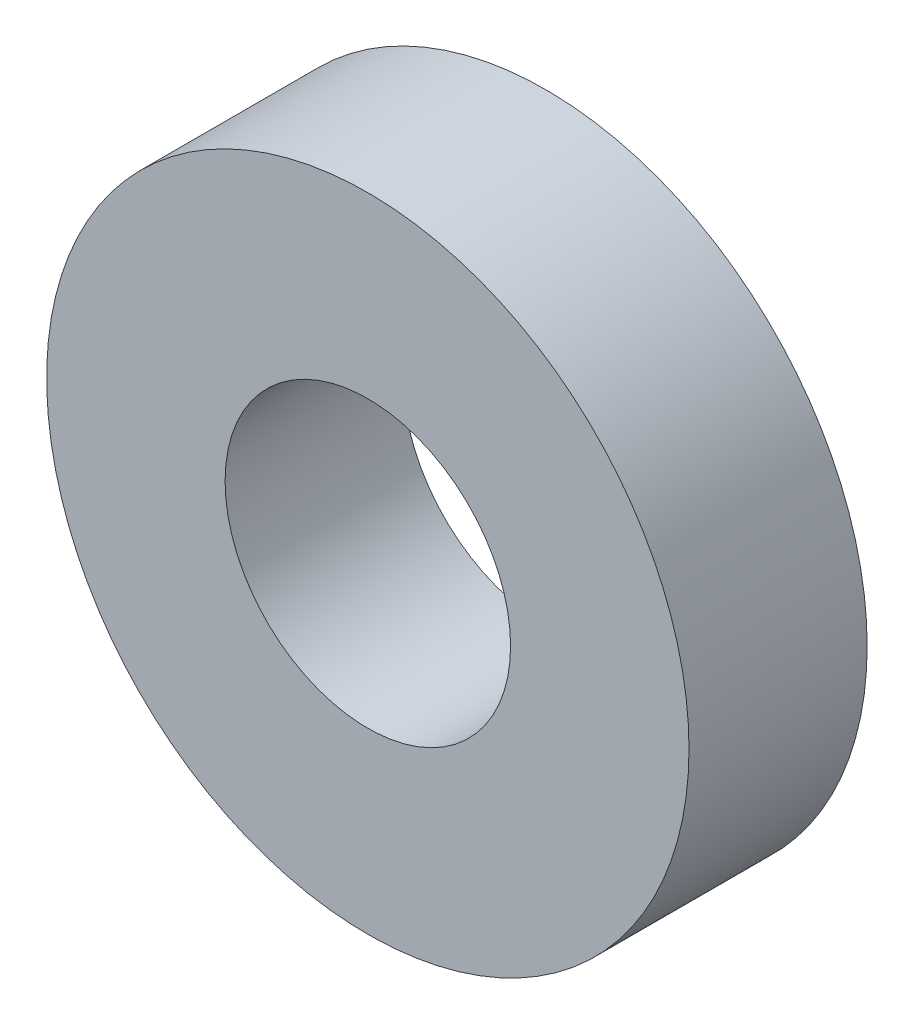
ISO-10303-21;
HEADER;
FILE_DESCRIPTION(('STEP AP214'),'2;1');
FILE_NAME('part.step','',(''),(''),'','','');
FILE_SCHEMA(('AUTOMOTIVE_DESIGN { 1 0 10303 214 1 1 1 1 }'));
ENDSEC;
DATA;
#1=APPLICATION_CONTEXT('core data for automotive mechanical design processes');
#2=APPLICATION_PROTOCOL_DEFINITION('international standard','automotive_design',2000,#1);
#3=PRODUCT_CONTEXT('',#1,'mechanical');
#4=PRODUCT('Part','Part','',(#3));
#5=PRODUCT_RELATED_PRODUCT_CATEGORY('part','',(#4));
#6=PRODUCT_DEFINITION_FORMATION('','',#4);
#7=PRODUCT_DEFINITION_CONTEXT('part definition',#1,'design');
#8=PRODUCT_DEFINITION('design','',#6,#7);
#9=PRODUCT_DEFINITION_SHAPE('','',#8);
#10=(LENGTH_UNIT() NAMED_UNIT(*) SI_UNIT(.MILLI.,.METRE.));
#11=(NAMED_UNIT(*) PLANE_ANGLE_UNIT() SI_UNIT($,.RADIAN.));
#12=(NAMED_UNIT(*) SI_UNIT($,.STERADIAN.) SOLID_ANGLE_UNIT());
#13=UNCERTAINTY_MEASURE_WITH_UNIT(LENGTH_MEASURE(1.E-05),#10,'distance_accuracy_value','');
#14=(GEOMETRIC_REPRESENTATION_CONTEXT(3) GLOBAL_UNCERTAINTY_ASSIGNED_CONTEXT((#13)) GLOBAL_UNIT_ASSIGNED_CONTEXT((#10,
#11,#12)) REPRESENTATION_CONTEXT('',''));
#15=CARTESIAN_POINT('',(0.,0.,0.));
#16=DIRECTION('',(0.,0.,1.));
#17=DIRECTION('',(1.,0.,0.));
#18=AXIS2_PLACEMENT_3D('',#15,#16,#17);
#19=CARTESIAN_POINT('',(0.,0.,7.9248));
#20=DIRECTION('',(0.,0.,1.));
#21=DIRECTION('',(1.,0.,0.));
#22=AXIS2_PLACEMENT_3D('',#19,#20,#21);
#23=PLANE('',#22);
#24=CARTESIAN_POINT('',(0.,0.,7.9248));
#25=DIRECTION('',(0.,0.,1.));
#26=DIRECTION('',(1.,0.,0.));
#27=AXIS2_PLACEMENT_3D('',#24,#25,#26);
#28=CIRCLE('',#27,14.2875);
#29=CARTESIAN_POINT('',(14.2875,0.,7.9248));
#30=VERTEX_POINT('',#29);
#31=EDGE_CURVE('E10',#30,#30,#28,.T.);
#32=ORIENTED_EDGE('',*,*,#31,.T.);
#33=EDGE_LOOP('',(#32));
#34=FACE_BOUND('',#33,.T.);
#35=CARTESIAN_POINT('',(0.,0.,7.9248));
#36=DIRECTION('',(0.,0.,1.));
#37=DIRECTION('',(1.,0.,0.));
#38=AXIS2_PLACEMENT_3D('',#35,#36,#37);
#39=CIRCLE('',#38,6.35);
#40=CARTESIAN_POINT('',(6.35,0.,7.9248));
#41=VERTEX_POINT('',#40);
#42=EDGE_CURVE('E44',#41,#41,#39,.T.);
#43=ORIENTED_EDGE('',*,*,#42,.F.);
#44=EDGE_LOOP('',(#43));
#45=FACE_BOUND('',#44,.T.);
#46=ADVANCED_FACE('F33',(#34,#45),#23,.T.);
#47=CARTESIAN_POINT('',(0.,0.,0.));
#48=DIRECTION('',(0.,0.,1.));
#49=DIRECTION('',(1.,0.,0.));
#50=AXIS2_PLACEMENT_3D('',#47,#48,#49);
#51=PLANE('',#50);
#52=CARTESIAN_POINT('',(0.,0.,0.));
#53=DIRECTION('',(0.,0.,1.));
#54=DIRECTION('',(1.,0.,0.));
#55=AXIS2_PLACEMENT_3D('',#52,#53,#54);
#56=CIRCLE('',#55,14.2875);
#57=CARTESIAN_POINT('',(14.2875,0.,0.));
#58=VERTEX_POINT('',#57);
#59=EDGE_CURVE('E37',#58,#58,#56,.T.);
#60=ORIENTED_EDGE('',*,*,#59,.F.);
#61=EDGE_LOOP('',(#60));
#62=FACE_BOUND('',#61,.T.);
#63=CARTESIAN_POINT('',(0.,0.,0.));
#64=DIRECTION('',(0.,0.,1.));
#65=DIRECTION('',(1.,0.,0.));
#66=AXIS2_PLACEMENT_3D('',#63,#64,#65);
#67=CIRCLE('',#66,6.35);
#68=CARTESIAN_POINT('',(6.35,0.,0.));
#69=VERTEX_POINT('',#68);
#70=EDGE_CURVE('E46',#69,#69,#67,.T.);
#71=ORIENTED_EDGE('',*,*,#70,.T.);
#72=EDGE_LOOP('',(#71));
#73=FACE_BOUND('',#72,.T.);
#74=ADVANCED_FACE('F56',(#62,#73),#51,.F.);
#75=CARTESIAN_POINT('',(0.,0.,7.9248));
#76=DIRECTION('',(0.,0.,-1.));
#77=DIRECTION('',(-1.,0.,0.));
#78=AXIS2_PLACEMENT_3D('',#75,#76,#77);
#79=CYLINDRICAL_SURFACE('',#78,14.2875);
#80=ORIENTED_EDGE('',*,*,#31,.F.);
#81=EDGE_LOOP('',(#80));
#82=FACE_BOUND('',#81,.T.);
#83=ORIENTED_EDGE('',*,*,#59,.T.);
#84=EDGE_LOOP('',(#83));
#85=FACE_BOUND('',#84,.T.);
#86=ADVANCED_FACE('F35',(#82,#85),#79,.T.);
#87=CARTESIAN_POINT('',(0.,0.,7.9248));
#88=DIRECTION('',(0.,0.,-1.));
#89=DIRECTION('',(-1.,0.,0.));
#90=AXIS2_PLACEMENT_3D('',#87,#88,#89);
#91=CYLINDRICAL_SURFACE('',#90,6.35);
#92=ORIENTED_EDGE('',*,*,#42,.T.);
#93=EDGE_LOOP('',(#92));
#94=FACE_BOUND('',#93,.T.);
#95=ORIENTED_EDGE('',*,*,#70,.F.);
#96=EDGE_LOOP('',(#95));
#97=FACE_BOUND('',#96,.T.);
#98=ADVANCED_FACE('F52',(#94,#97),#91,.F.);
#99=CLOSED_SHELL('',(#46,#74,#86,#98));
#100=MANIFOLD_SOLID_BREP('B2',#99);
#101=ADVANCED_BREP_SHAPE_REPRESENTATION('',(#18,#100),#14);
#102=SHAPE_DEFINITION_REPRESENTATION(#9,#101);
ENDSEC;
END-ISO-10303-21;
